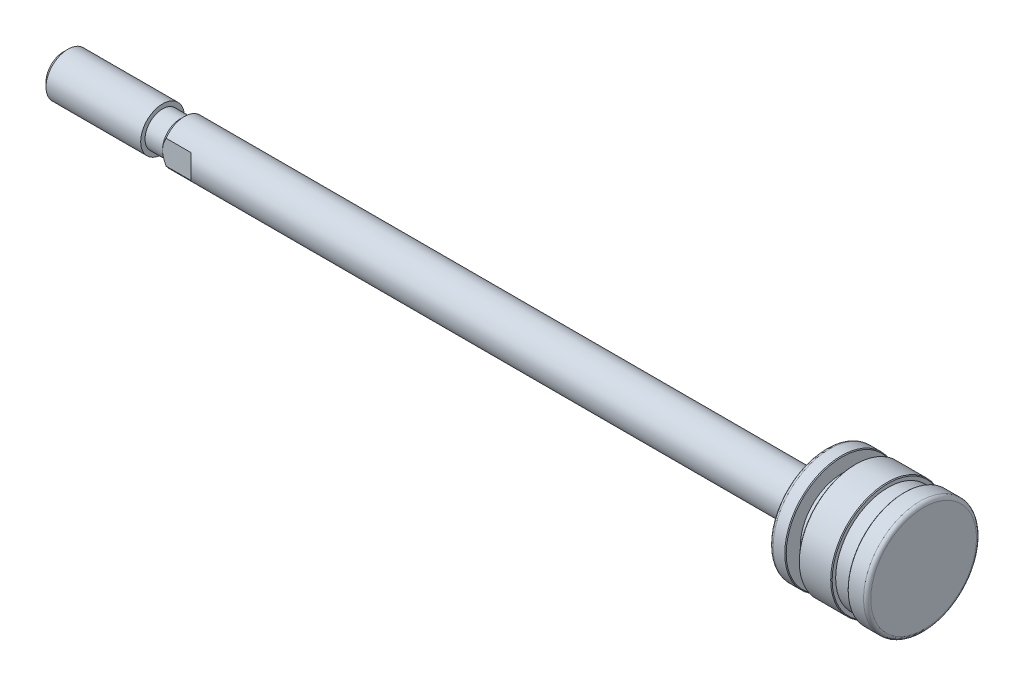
ISO-10303-21;
HEADER;
FILE_DESCRIPTION(('STEP AP214'),'2;1');
FILE_NAME('part.step','',(''),(''),'','','');
FILE_SCHEMA(('AUTOMOTIVE_DESIGN { 1 0 10303 214 1 1 1 1 }'));
ENDSEC;
DATA;
#1=APPLICATION_CONTEXT('core data for automotive mechanical design processes');
#2=APPLICATION_PROTOCOL_DEFINITION('international standard','automotive_design',2000,#1);
#3=PRODUCT_CONTEXT('',#1,'mechanical');
#4=PRODUCT('Part','Part','',(#3));
#5=PRODUCT_RELATED_PRODUCT_CATEGORY('part','',(#4));
#6=PRODUCT_DEFINITION_FORMATION('','',#4);
#7=PRODUCT_DEFINITION_CONTEXT('part definition',#1,'design');
#8=PRODUCT_DEFINITION('design','',#6,#7);
#9=PRODUCT_DEFINITION_SHAPE('','',#8);
#10=(LENGTH_UNIT() NAMED_UNIT(*) SI_UNIT(.MILLI.,.METRE.));
#11=(NAMED_UNIT(*) PLANE_ANGLE_UNIT() SI_UNIT($,.RADIAN.));
#12=(NAMED_UNIT(*) SI_UNIT($,.STERADIAN.) SOLID_ANGLE_UNIT());
#13=UNCERTAINTY_MEASURE_WITH_UNIT(LENGTH_MEASURE(1.E-05),#10,'distance_accuracy_value','');
#14=(GEOMETRIC_REPRESENTATION_CONTEXT(3) GLOBAL_UNCERTAINTY_ASSIGNED_CONTEXT((#13)) GLOBAL_UNIT_ASSIGNED_CONTEXT((#10,
#11,#12)) REPRESENTATION_CONTEXT('',''));
#15=CARTESIAN_POINT('',(0.,0.,0.));
#16=DIRECTION('',(0.,0.,1.));
#17=DIRECTION('',(1.,0.,0.));
#18=AXIS2_PLACEMENT_3D('',#15,#16,#17);
#19=CARTESIAN_POINT('',(80.,7.25,0.));
#20=DIRECTION('',(-1.,0.,0.));
#21=DIRECTION('',(0.,0.,1.));
#22=AXIS2_PLACEMENT_3D('',#19,#20,#21);
#23=PLANE('',#22);
#24=CARTESIAN_POINT('',(80.,0.,0.));
#25=DIRECTION('',(-1.,0.,0.));
#26=DIRECTION('',(0.,0.,-1.));
#27=AXIS2_PLACEMENT_3D('',#24,#25,#26);
#28=CIRCLE('',#27,7.25);
#29=CARTESIAN_POINT('',(80.,0.,-7.25));
#30=VERTEX_POINT('',#29);
#31=CARTESIAN_POINT('',(80.,0.,7.25));
#32=VERTEX_POINT('',#31);
#33=EDGE_CURVE('E237',#30,#32,#28,.T.);
#34=ORIENTED_EDGE('',*,*,#33,.F.);
#35=CARTESIAN_POINT('',(80.,0.,0.));
#36=DIRECTION('',(-1.,0.,0.));
#37=DIRECTION('',(0.,0.,1.));
#38=AXIS2_PLACEMENT_3D('',#35,#36,#37);
#39=CIRCLE('',#38,7.25);
#40=EDGE_CURVE('E539',#32,#30,#39,.T.);
#41=ORIENTED_EDGE('',*,*,#40,.F.);
#42=EDGE_LOOP('',(#34,#41));
#43=FACE_BOUND('',#42,.T.);
#44=ADVANCED_FACE('F17',(#43),#23,.F.);
#45=CARTESIAN_POINT('',(79.5,0.,0.));
#46=DIRECTION('',(-1.,0.,0.));
#47=DIRECTION('',(0.,0.,1.));
#48=AXIS2_PLACEMENT_3D('',#45,#46,#47);
#49=TOROIDAL_SURFACE('',#48,7.25,0.500000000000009);
#50=ORIENTED_EDGE('',*,*,#40,.T.);
#51=ORIENTED_EDGE('',*,*,#33,.T.);
#52=EDGE_LOOP('',(#50,#51));
#53=FACE_BOUND('',#52,.T.);
#54=CARTESIAN_POINT('',(79.5,0.,0.));
#55=DIRECTION('',(-1.,0.,0.));
#56=DIRECTION('',(0.,0.,1.));
#57=AXIS2_PLACEMENT_3D('',#54,#55,#56);
#58=CIRCLE('',#57,7.75);
#59=CARTESIAN_POINT('',(79.5,0.,7.75));
#60=VERTEX_POINT('',#59);
#61=EDGE_CURVE('E234',#60,#60,#58,.T.);
#62=ORIENTED_EDGE('',*,*,#61,.F.);
#63=EDGE_LOOP('',(#62));
#64=FACE_BOUND('',#63,.T.);
#65=ADVANCED_FACE('F242',(#53,#64),#49,.T.);
#66=CARTESIAN_POINT('',(80.,0.,0.));
#67=DIRECTION('',(-1.,0.,0.));
#68=DIRECTION('',(0.,0.,1.));
#69=AXIS2_PLACEMENT_3D('',#66,#67,#68);
#70=CYLINDRICAL_SURFACE('',#69,7.75);
#71=ORIENTED_EDGE('',*,*,#61,.T.);
#72=EDGE_LOOP('',(#71));
#73=FACE_BOUND('',#72,.T.);
#74=CARTESIAN_POINT('',(77.4,0.,0.));
#75=DIRECTION('',(1.,0.,0.));
#76=DIRECTION('',(0.,0.,-1.));
#77=AXIS2_PLACEMENT_3D('',#74,#75,#76);
#78=CIRCLE('',#77,7.75);
#79=CARTESIAN_POINT('',(77.4,0.,-7.75));
#80=VERTEX_POINT('',#79);
#81=EDGE_CURVE('E225',#80,#80,#78,.F.);
#82=ORIENTED_EDGE('',*,*,#81,.F.);
#83=EDGE_LOOP('',(#82));
#84=FACE_BOUND('',#83,.T.);
#85=ADVANCED_FACE('F246',(#73,#84),#70,.T.);
#86=CARTESIAN_POINT('',(77.4,0.,0.));
#87=DIRECTION('',(1.,0.,0.));
#88=DIRECTION('',(0.,0.,-1.));
#89=AXIS2_PLACEMENT_3D('',#86,#87,#88);
#90=CONICAL_SURFACE('',#89,7.75,0.785398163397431);
#91=CARTESIAN_POINT('',(77.3,0.,0.));
#92=DIRECTION('',(1.,0.,0.));
#93=DIRECTION('',(0.,0.,-1.));
#94=AXIS2_PLACEMENT_3D('',#91,#92,#93);
#95=CIRCLE('',#94,7.65);
#96=CARTESIAN_POINT('',(77.3,0.,-7.65));
#97=VERTEX_POINT('',#96);
#98=EDGE_CURVE('E233',#97,#97,#95,.T.);
#99=ORIENTED_EDGE('',*,*,#98,.T.);
#100=EDGE_LOOP('',(#99));
#101=FACE_BOUND('',#100,.T.);
#102=ORIENTED_EDGE('',*,*,#81,.T.);
#103=EDGE_LOOP('',(#102));
#104=FACE_BOUND('',#103,.T.);
#105=ADVANCED_FACE('F501',(#101,#104),#90,.T.);
#106=CARTESIAN_POINT('',(77.3,7.27,0.));
#107=DIRECTION('',(1.,0.,0.));
#108=DIRECTION('',(0.,0.,-1.));
#109=AXIS2_PLACEMENT_3D('',#106,#107,#108);
#110=PLANE('',#109);
#111=ORIENTED_EDGE('',*,*,#98,.F.);
#112=EDGE_LOOP('',(#111));
#113=FACE_BOUND('',#112,.T.);
#114=CARTESIAN_POINT('',(77.3,0.,0.));
#115=DIRECTION('',(-1.,0.,0.));
#116=DIRECTION('',(0.,0.,-1.));
#117=AXIS2_PLACEMENT_3D('',#114,#115,#116);
#118=CIRCLE('',#117,7.26999999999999);
#119=CARTESIAN_POINT('',(77.3,0.,7.26999999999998));
#120=VERTEX_POINT('',#119);
#121=CARTESIAN_POINT('',(77.3,0.,-7.26999999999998));
#122=VERTEX_POINT('',#121);
#123=EDGE_CURVE('E171',#120,#122,#118,.F.);
#124=ORIENTED_EDGE('',*,*,#123,.T.);
#125=CARTESIAN_POINT('',(77.3,0.,0.));
#126=DIRECTION('',(-1.,0.,0.));
#127=DIRECTION('',(0.,0.,1.));
#128=AXIS2_PLACEMENT_3D('',#125,#126,#127);
#129=CIRCLE('',#128,7.26999999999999);
#130=EDGE_CURVE('E213',#122,#120,#129,.F.);
#131=ORIENTED_EDGE('',*,*,#130,.T.);
#132=EDGE_LOOP('',(#124,#131));
#133=FACE_BOUND('',#132,.T.);
#134=ADVANCED_FACE('F188',(#113,#133),#110,.F.);
#135=CARTESIAN_POINT('',(77.2,0.,0.));
#136=DIRECTION('',(-1.,0.,0.));
#137=DIRECTION('',(0.,0.,1.));
#138=AXIS2_PLACEMENT_3D('',#135,#136,#137);
#139=TOROIDAL_SURFACE('',#138,7.26999999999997,0.099999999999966);
#140=CARTESIAN_POINT('',(77.2,0.,0.));
#141=DIRECTION('',(-1.,0.,0.));
#142=DIRECTION('',(0.,0.,1.));
#143=AXIS2_PLACEMENT_3D('',#140,#141,#142);
#144=CIRCLE('',#143,7.17);
#145=CARTESIAN_POINT('',(77.2,0.,7.17));
#146=VERTEX_POINT('',#145);
#147=EDGE_CURVE('E198',#146,#146,#144,.T.);
#148=ORIENTED_EDGE('',*,*,#147,.F.);
#149=EDGE_LOOP('',(#148));
#150=FACE_BOUND('',#149,.T.);
#151=ORIENTED_EDGE('',*,*,#123,.F.);
#152=ORIENTED_EDGE('',*,*,#130,.F.);
#153=EDGE_LOOP('',(#151,#152));
#154=FACE_BOUND('',#153,.T.);
#155=ADVANCED_FACE('F176',(#150,#154),#139,.F.);
#156=CARTESIAN_POINT('',(80.,0.,0.));
#157=DIRECTION('',(-1.,0.,0.));
#158=DIRECTION('',(0.,0.,1.));
#159=AXIS2_PLACEMENT_3D('',#156,#157,#158);
#160=CYLINDRICAL_SURFACE('',#159,7.17);
#161=CARTESIAN_POINT('',(75.1,0.,0.));
#162=DIRECTION('',(-1.,0.,0.));
#163=DIRECTION('',(0.,0.,1.));
#164=AXIS2_PLACEMENT_3D('',#161,#162,#163);
#165=CIRCLE('',#164,7.17);
#166=CARTESIAN_POINT('',(75.1,0.,7.17));
#167=VERTEX_POINT('',#166);
#168=EDGE_CURVE('E576',#167,#167,#165,.F.);
#169=ORIENTED_EDGE('',*,*,#168,.T.);
#170=EDGE_LOOP('',(#169));
#171=FACE_BOUND('',#170,.T.);
#172=ORIENTED_EDGE('',*,*,#147,.T.);
#173=EDGE_LOOP('',(#172));
#174=FACE_BOUND('',#173,.T.);
#175=ADVANCED_FACE('F187',(#171,#174),#160,.T.);
#176=CARTESIAN_POINT('',(75.1,7.65,0.));
#177=DIRECTION('',(-1.,0.,0.));
#178=DIRECTION('',(0.,0.,1.));
#179=AXIS2_PLACEMENT_3D('',#176,#177,#178);
#180=PLANE('',#179);
#181=ORIENTED_EDGE('',*,*,#168,.F.);
#182=EDGE_LOOP('',(#181));
#183=FACE_BOUND('',#182,.T.);
#184=CARTESIAN_POINT('',(75.1,0.,0.));
#185=DIRECTION('',(-1.,0.,0.));
#186=DIRECTION('',(0.,0.,1.));
#187=AXIS2_PLACEMENT_3D('',#184,#185,#186);
#188=CIRCLE('',#187,7.65);
#189=CARTESIAN_POINT('',(75.1,0.,7.65));
#190=VERTEX_POINT('',#189);
#191=EDGE_CURVE('E573',#190,#190,#188,.T.);
#192=ORIENTED_EDGE('',*,*,#191,.F.);
#193=EDGE_LOOP('',(#192));
#194=FACE_BOUND('',#193,.T.);
#195=ADVANCED_FACE('F469',(#183,#194),#180,.F.);
#196=CARTESIAN_POINT('',(75.,0.,0.));
#197=DIRECTION('',(-1.,0.,0.));
#198=DIRECTION('',(0.,0.,1.));
#199=AXIS2_PLACEMENT_3D('',#196,#197,#198);
#200=CONICAL_SURFACE('',#199,7.75,0.785398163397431);
#201=ORIENTED_EDGE('',*,*,#191,.T.);
#202=EDGE_LOOP('',(#201));
#203=FACE_BOUND('',#202,.T.);
#204=CARTESIAN_POINT('',(75.,0.,0.));
#205=DIRECTION('',(-1.,0.,0.));
#206=DIRECTION('',(0.,0.,1.));
#207=AXIS2_PLACEMENT_3D('',#204,#205,#206);
#208=CIRCLE('',#207,7.75);
#209=CARTESIAN_POINT('',(75.,0.,7.75));
#210=VERTEX_POINT('',#209);
#211=EDGE_CURVE('E571',#210,#210,#208,.T.);
#212=ORIENTED_EDGE('',*,*,#211,.F.);
#213=EDGE_LOOP('',(#212));
#214=FACE_BOUND('',#213,.T.);
#215=ADVANCED_FACE('F459',(#203,#214),#200,.T.);
#216=CARTESIAN_POINT('',(80.,0.,0.));
#217=DIRECTION('',(-1.,0.,0.));
#218=DIRECTION('',(0.,0.,1.));
#219=AXIS2_PLACEMENT_3D('',#216,#217,#218);
#220=CYLINDRICAL_SURFACE('',#219,7.75);
#221=ORIENTED_EDGE('',*,*,#211,.T.);
#222=EDGE_LOOP('',(#221));
#223=FACE_BOUND('',#222,.T.);
#224=CARTESIAN_POINT('',(70.7,0.,0.));
#225=DIRECTION('',(1.,0.,0.));
#226=DIRECTION('',(0.,0.,-1.));
#227=AXIS2_PLACEMENT_3D('',#224,#225,#226);
#228=CIRCLE('',#227,7.75);
#229=CARTESIAN_POINT('',(70.7,0.,-7.75));
#230=VERTEX_POINT('',#229);
#231=EDGE_CURVE('E568',#230,#230,#228,.F.);
#232=ORIENTED_EDGE('',*,*,#231,.F.);
#233=EDGE_LOOP('',(#232));
#234=FACE_BOUND('',#233,.T.);
#235=ADVANCED_FACE('F449',(#223,#234),#220,.T.);
#236=CARTESIAN_POINT('',(70.7,0.,0.));
#237=DIRECTION('',(1.,0.,0.));
#238=DIRECTION('',(0.,0.,-1.));
#239=AXIS2_PLACEMENT_3D('',#236,#237,#238);
#240=CONICAL_SURFACE('',#239,7.75,0.7853981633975);
#241=CARTESIAN_POINT('',(70.6,0.,0.));
#242=DIRECTION('',(1.,0.,0.));
#243=DIRECTION('',(0.,0.,-1.));
#244=AXIS2_PLACEMENT_3D('',#241,#242,#243);
#245=CIRCLE('',#244,7.65);
#246=CARTESIAN_POINT('',(70.6,0.,-7.65));
#247=VERTEX_POINT('',#246);
#248=EDGE_CURVE('E570',#247,#247,#245,.T.);
#249=ORIENTED_EDGE('',*,*,#248,.T.);
#250=EDGE_LOOP('',(#249));
#251=FACE_BOUND('',#250,.T.);
#252=ORIENTED_EDGE('',*,*,#231,.T.);
#253=EDGE_LOOP('',(#252));
#254=FACE_BOUND('',#253,.T.);
#255=ADVANCED_FACE('F439',(#251,#254),#240,.T.);
#256=CARTESIAN_POINT('',(70.6,5.7,0.));
#257=DIRECTION('',(1.,0.,0.));
#258=DIRECTION('',(0.,0.,-1.));
#259=AXIS2_PLACEMENT_3D('',#256,#257,#258);
#260=PLANE('',#259);
#261=ORIENTED_EDGE('',*,*,#248,.F.);
#262=EDGE_LOOP('',(#261));
#263=FACE_BOUND('',#262,.T.);
#264=CARTESIAN_POINT('',(70.6,0.,0.));
#265=DIRECTION('',(-1.,0.,0.));
#266=DIRECTION('',(0.,0.,1.));
#267=AXIS2_PLACEMENT_3D('',#264,#265,#266);
#268=CIRCLE('',#267,5.7);
#269=CARTESIAN_POINT('',(70.6,0.,5.7));
#270=VERTEX_POINT('',#269);
#271=EDGE_CURVE('E589',#270,#270,#268,.T.);
#272=ORIENTED_EDGE('',*,*,#271,.F.);
#273=EDGE_LOOP('',(#272));
#274=FACE_BOUND('',#273,.T.);
#275=ADVANCED_FACE('F429',(#263,#274),#260,.F.);
#276=CARTESIAN_POINT('',(80.,0.,0.));
#277=DIRECTION('',(-1.,0.,0.));
#278=DIRECTION('',(0.,0.,1.));
#279=AXIS2_PLACEMENT_3D('',#276,#277,#278);
#280=CYLINDRICAL_SURFACE('',#279,5.7);
#281=CARTESIAN_POINT('',(68.8,0.,0.));
#282=DIRECTION('',(-1.,0.,0.));
#283=DIRECTION('',(0.,0.,1.));
#284=AXIS2_PLACEMENT_3D('',#281,#282,#283);
#285=CIRCLE('',#284,5.7);
#286=CARTESIAN_POINT('',(68.8,0.,5.7));
#287=VERTEX_POINT('',#286);
#288=EDGE_CURVE('E592',#287,#287,#285,.F.);
#289=ORIENTED_EDGE('',*,*,#288,.T.);
#290=EDGE_LOOP('',(#289));
#291=FACE_BOUND('',#290,.T.);
#292=ORIENTED_EDGE('',*,*,#271,.T.);
#293=EDGE_LOOP('',(#292));
#294=FACE_BOUND('',#293,.T.);
#295=ADVANCED_FACE('F419',(#291,#294),#280,.T.);
#296=CARTESIAN_POINT('',(68.8,7.65,0.));
#297=DIRECTION('',(-1.,0.,0.));
#298=DIRECTION('',(0.,0.,1.));
#299=AXIS2_PLACEMENT_3D('',#296,#297,#298);
#300=PLANE('',#299);
#301=ORIENTED_EDGE('',*,*,#288,.F.);
#302=EDGE_LOOP('',(#301));
#303=FACE_BOUND('',#302,.T.);
#304=CARTESIAN_POINT('',(68.8,0.,0.));
#305=DIRECTION('',(-1.,0.,0.));
#306=DIRECTION('',(0.,0.,1.));
#307=AXIS2_PLACEMENT_3D('',#304,#305,#306);
#308=CIRCLE('',#307,7.65);
#309=CARTESIAN_POINT('',(68.8,0.,7.65));
#310=VERTEX_POINT('',#309);
#311=EDGE_CURVE('E567',#310,#310,#308,.T.);
#312=ORIENTED_EDGE('',*,*,#311,.F.);
#313=EDGE_LOOP('',(#312));
#314=FACE_BOUND('',#313,.T.);
#315=ADVANCED_FACE('F409',(#303,#314),#300,.F.);
#316=CARTESIAN_POINT('',(68.7,0.,0.));
#317=DIRECTION('',(-1.,0.,0.));
#318=DIRECTION('',(0.,0.,1.));
#319=AXIS2_PLACEMENT_3D('',#316,#317,#318);
#320=CONICAL_SURFACE('',#319,7.74999999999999,0.7853981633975);
#321=CARTESIAN_POINT('',(68.7,0.,0.));
#322=DIRECTION('',(-1.,0.,0.));
#323=DIRECTION('',(0.,0.,1.));
#324=AXIS2_PLACEMENT_3D('',#321,#322,#323);
#325=CIRCLE('',#324,7.75);
#326=CARTESIAN_POINT('',(68.7,0.,7.75));
#327=VERTEX_POINT('',#326);
#328=EDGE_CURVE('E564',#327,#327,#325,.T.);
#329=ORIENTED_EDGE('',*,*,#328,.F.);
#330=EDGE_LOOP('',(#329));
#331=FACE_BOUND('',#330,.T.);
#332=ORIENTED_EDGE('',*,*,#311,.T.);
#333=EDGE_LOOP('',(#332));
#334=FACE_BOUND('',#333,.T.);
#335=ADVANCED_FACE('F399',(#331,#334),#320,.T.);
#336=CARTESIAN_POINT('',(-38.,0.,0.));
#337=DIRECTION('',(1.,0.,0.));
#338=DIRECTION('',(0.,0.,-1.));
#339=AXIS2_PLACEMENT_3D('',#336,#337,#338);
#340=PLANE('',#339);
#341=CARTESIAN_POINT('',(-37.9999999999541,0.,0.));
#342=DIRECTION('',(1.,0.,0.));
#343=DIRECTION('',(0.,0.,-1.));
#344=AXIS2_PLACEMENT_3D('',#341,#342,#343);
#345=CIRCLE('',#344,2.38649999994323);
#346=CARTESIAN_POINT('',(-37.9999999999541,0.,-2.38649999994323));
#347=VERTEX_POINT('',#346);
#348=EDGE_CURVE('E561',#347,#347,#345,.T.);
#349=ORIENTED_EDGE('',*,*,#348,.F.);
#350=EDGE_LOOP('',(#349));
#351=FACE_BOUND('',#350,.T.);
#352=ADVANCED_FACE('F390',(#351),#340,.F.);
#353=CARTESIAN_POINT('',(80.,0.,0.));
#354=DIRECTION('',(-1.,0.,0.));
#355=DIRECTION('',(0.,0.,1.));
#356=AXIS2_PLACEMENT_3D('',#353,#354,#355);
#357=CYLINDRICAL_SURFACE('',#356,7.75);
#358=CARTESIAN_POINT('',(67.1,0.,0.));
#359=DIRECTION('',(-1.,0.,0.));
#360=DIRECTION('',(0.,0.,1.));
#361=AXIS2_PLACEMENT_3D('',#358,#359,#360);
#362=CIRCLE('',#361,7.75);
#363=CARTESIAN_POINT('',(67.1,0.,7.75));
#364=VERTEX_POINT('',#363);
#365=EDGE_CURVE('E558',#364,#364,#362,.T.);
#366=ORIENTED_EDGE('',*,*,#365,.F.);
#367=EDGE_LOOP('',(#366));
#368=FACE_BOUND('',#367,.T.);
#369=ORIENTED_EDGE('',*,*,#328,.T.);
#370=EDGE_LOOP('',(#369));
#371=FACE_BOUND('',#370,.T.);
#372=ADVANCED_FACE('F381',(#368,#371),#357,.T.);
#373=CARTESIAN_POINT('',(-37.3864999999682,0.,0.));
#374=DIRECTION('',(1.,0.,0.));
#375=DIRECTION('',(0.,0.,-1.));
#376=AXIS2_PLACEMENT_3D('',#373,#374,#375);
#377=CONICAL_SURFACE('',#376,2.99999999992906,0.785398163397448);
#378=CARTESIAN_POINT('',(-37.3865,0.,0.));
#379=DIRECTION('',(-1.,0.,0.));
#380=DIRECTION('',(0.,0.,1.));
#381=AXIS2_PLACEMENT_3D('',#378,#379,#380);
#382=CIRCLE('',#381,3.);
#383=CARTESIAN_POINT('',(-37.3865,0.,3.));
#384=VERTEX_POINT('',#383);
#385=EDGE_CURVE('E556',#384,#384,#382,.F.);
#386=ORIENTED_EDGE('',*,*,#385,.F.);
#387=EDGE_LOOP('',(#386));
#388=FACE_BOUND('',#387,.T.);
#389=ORIENTED_EDGE('',*,*,#348,.T.);
#390=EDGE_LOOP('',(#389));
#391=FACE_BOUND('',#390,.T.);
#392=ADVANCED_FACE('F147',(#388,#391),#377,.T.);
#393=CARTESIAN_POINT('',(67.1,0.,0.));
#394=DIRECTION('',(-1.,0.,0.));
#395=DIRECTION('',(0.,0.,1.));
#396=AXIS2_PLACEMENT_3D('',#393,#394,#395);
#397=TOROIDAL_SURFACE('',#396,7.25,0.500000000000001);
#398=CARTESIAN_POINT('',(66.6,0.,0.));
#399=DIRECTION('',(1.,0.,0.));
#400=DIRECTION('',(0.,0.,1.));
#401=AXIS2_PLACEMENT_3D('',#398,#399,#400);
#402=CIRCLE('',#401,7.25);
#403=CARTESIAN_POINT('',(66.6,0.,7.25));
#404=VERTEX_POINT('',#403);
#405=CARTESIAN_POINT('',(66.6,0.,-7.25));
#406=VERTEX_POINT('',#405);
#407=EDGE_CURVE('E110',#404,#406,#402,.T.);
#408=ORIENTED_EDGE('',*,*,#407,.T.);
#409=CARTESIAN_POINT('',(66.6,0.,0.));
#410=DIRECTION('',(1.,0.,0.));
#411=DIRECTION('',(0.,0.,-1.));
#412=AXIS2_PLACEMENT_3D('',#409,#410,#411);
#413=CIRCLE('',#412,7.25);
#414=EDGE_CURVE('E550',#406,#404,#413,.T.);
#415=ORIENTED_EDGE('',*,*,#414,.T.);
#416=EDGE_LOOP('',(#408,#415));
#417=FACE_BOUND('',#416,.T.);
#418=ORIENTED_EDGE('',*,*,#365,.T.);
#419=EDGE_LOOP('',(#418));
#420=FACE_BOUND('',#419,.T.);
#421=ADVANCED_FACE('F143',(#417,#420),#397,.T.);
#422=CARTESIAN_POINT('',(80.,0.,0.));
#423=DIRECTION('',(-1.,0.,0.));
#424=DIRECTION('',(0.,0.,1.));
#425=AXIS2_PLACEMENT_3D('',#422,#423,#424);
#426=CYLINDRICAL_SURFACE('',#425,3.);
#427=ORIENTED_EDGE('',*,*,#385,.T.);
#428=EDGE_LOOP('',(#427));
#429=FACE_BOUND('',#428,.T.);
#430=CARTESIAN_POINT('',(-24.4,0.,0.));
#431=DIRECTION('',(-1.,0.,0.));
#432=DIRECTION('',(0.,0.,1.));
#433=AXIS2_PLACEMENT_3D('',#430,#431,#432);
#434=CIRCLE('',#433,3.);
#435=CARTESIAN_POINT('',(-24.4,0.,3.));
#436=VERTEX_POINT('',#435);
#437=EDGE_CURVE('E552',#436,#436,#434,.T.);
#438=ORIENTED_EDGE('',*,*,#437,.T.);
#439=EDGE_LOOP('',(#438));
#440=FACE_BOUND('',#439,.T.);
#441=ADVANCED_FACE('F127',(#429,#440),#426,.T.);
#442=CARTESIAN_POINT('',(66.6,2.9,0.));
#443=DIRECTION('',(1.,0.,0.));
#444=DIRECTION('',(0.,0.,-1.));
#445=AXIS2_PLACEMENT_3D('',#442,#443,#444);
#446=PLANE('',#445);
#447=ORIENTED_EDGE('',*,*,#407,.F.);
#448=ORIENTED_EDGE('',*,*,#414,.F.);
#449=EDGE_LOOP('',(#447,#448));
#450=FACE_BOUND('',#449,.T.);
#451=CARTESIAN_POINT('',(66.6,0.,0.));
#452=DIRECTION('',(-1.,0.,0.));
#453=DIRECTION('',(0.,0.,1.));
#454=AXIS2_PLACEMENT_3D('',#451,#452,#453);
#455=CIRCLE('',#454,2.9);
#456=CARTESIAN_POINT('',(66.6,0.,2.9));
#457=VERTEX_POINT('',#456);
#458=EDGE_CURVE('E554',#457,#457,#455,.T.);
#459=ORIENTED_EDGE('',*,*,#458,.F.);
#460=EDGE_LOOP('',(#459));
#461=FACE_BOUND('',#460,.T.);
#462=ADVANCED_FACE('F116',(#450,#461),#446,.F.);
#463=CARTESIAN_POINT('',(-24.4,3.,0.));
#464=DIRECTION('',(-1.,0.,0.));
#465=DIRECTION('',(0.,0.,1.));
#466=AXIS2_PLACEMENT_3D('',#463,#464,#465);
#467=PLANE('',#466);
#468=CARTESIAN_POINT('',(-24.4,0.,0.));
#469=DIRECTION('',(-1.,0.,0.));
#470=DIRECTION('',(0.,0.,1.));
#471=AXIS2_PLACEMENT_3D('',#468,#469,#470);
#472=CIRCLE('',#471,2.4);
#473=CARTESIAN_POINT('',(-24.4,0.,2.4));
#474=VERTEX_POINT('',#473);
#475=EDGE_CURVE('E601',#474,#474,#472,.F.);
#476=ORIENTED_EDGE('',*,*,#475,.F.);
#477=EDGE_LOOP('',(#476));
#478=FACE_BOUND('',#477,.T.);
#479=ORIENTED_EDGE('',*,*,#437,.F.);
#480=EDGE_LOOP('',(#479));
#481=FACE_BOUND('',#480,.T.);
#482=ADVANCED_FACE('F126',(#478,#481),#467,.F.);
#483=CARTESIAN_POINT('',(80.,0.,0.));
#484=DIRECTION('',(-1.,0.,0.));
#485=DIRECTION('',(0.,0.,1.));
#486=AXIS2_PLACEMENT_3D('',#483,#484,#485);
#487=CYLINDRICAL_SURFACE('',#486,2.9);
#488=CARTESIAN_POINT('',(64.1,0.,0.));
#489=DIRECTION('',(-1.,0.,0.));
#490=DIRECTION('',(0.,0.,1.));
#491=AXIS2_PLACEMENT_3D('',#488,#489,#490);
#492=CIRCLE('',#491,2.9);
#493=CARTESIAN_POINT('',(64.1,0.,2.9));
#494=VERTEX_POINT('',#493);
#495=EDGE_CURVE('E100',#494,#494,#492,.F.);
#496=ORIENTED_EDGE('',*,*,#495,.T.);
#497=EDGE_LOOP('',(#496));
#498=FACE_BOUND('',#497,.T.);
#499=ORIENTED_EDGE('',*,*,#458,.T.);
#500=EDGE_LOOP('',(#499));
#501=FACE_BOUND('',#500,.T.);
#502=ADVANCED_FACE('F292',(#498,#501),#487,.T.);
#503=CARTESIAN_POINT('',(80.,0.,0.));
#504=DIRECTION('',(-1.,0.,0.));
#505=DIRECTION('',(0.,0.,1.));
#506=AXIS2_PLACEMENT_3D('',#503,#504,#505);
#507=CYLINDRICAL_SURFACE('',#506,2.4);
#508=ORIENTED_EDGE('',*,*,#475,.T.);
#509=EDGE_LOOP('',(#508));
#510=FACE_BOUND('',#509,.T.);
#511=CARTESIAN_POINT('',(-21.9999999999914,0.,0.));
#512=DIRECTION('',(1.,0.,0.));
#513=DIRECTION('',(0.,0.,-1.));
#514=AXIS2_PLACEMENT_3D('',#511,#512,#513);
#515=CIRCLE('',#514,2.40000000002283);
#516=CARTESIAN_POINT('',(-21.9999999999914,0.,-2.40000000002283));
#517=VERTEX_POINT('',#516);
#518=EDGE_CURVE('E75',#517,#517,#515,.T.);
#519=ORIENTED_EDGE('',*,*,#518,.F.);
#520=EDGE_LOOP('',(#519));
#521=FACE_BOUND('',#520,.T.);
#522=ADVANCED_FACE('F289',(#510,#521),#507,.T.);
#523=CARTESIAN_POINT('',(64.1,3.,0.));
#524=DIRECTION('',(-1.,0.,0.));
#525=DIRECTION('',(0.,0.,1.));
#526=AXIS2_PLACEMENT_3D('',#523,#524,#525);
#527=PLANE('',#526);
#528=ORIENTED_EDGE('',*,*,#495,.F.);
#529=EDGE_LOOP('',(#528));
#530=FACE_BOUND('',#529,.T.);
#531=CARTESIAN_POINT('',(64.1,0.,0.));
#532=DIRECTION('',(-1.,0.,0.));
#533=DIRECTION('',(0.,0.,1.));
#534=AXIS2_PLACEMENT_3D('',#531,#532,#533);
#535=CIRCLE('',#534,3.);
#536=CARTESIAN_POINT('',(64.1,0.,3.));
#537=VERTEX_POINT('',#536);
#538=EDGE_CURVE('E88',#537,#537,#535,.T.);
#539=ORIENTED_EDGE('',*,*,#538,.F.);
#540=EDGE_LOOP('',(#539));
#541=FACE_BOUND('',#540,.T.);
#542=ADVANCED_FACE('F285',(#530,#541),#527,.F.);
#543=CARTESIAN_POINT('',(-18.,-6.,-2.5));
#544=DIRECTION('',(0.707106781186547,0.,0.707106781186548));
#545=DIRECTION('',(0.707106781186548,0.,-0.707106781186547));
#546=AXIS2_PLACEMENT_3D('',#543,#544,#545);
#547=PLANE('',#546);
#548=CARTESIAN_POINT('',(-20.5,0.,0.));
#549=DIRECTION('',(0.707106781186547,0.,0.707106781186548));
#550=DIRECTION('',(-0.707106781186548,0.,0.707106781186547));
#551=AXIS2_PLACEMENT_3D('',#548,#549,#550);
#552=ELLIPSE('',#551,4.24264068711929,3.);
#553=CARTESIAN_POINT('',(-18.,-1.65831239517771,-2.5));
#554=VERTEX_POINT('',#553);
#555=CARTESIAN_POINT('',(-18.,1.65831239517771,-2.5));
#556=VERTEX_POINT('',#555);
#557=EDGE_CURVE('E86',#554,#556,#552,.T.);
#558=ORIENTED_EDGE('',*,*,#557,.F.);
#559=DIRECTION('',(0.,1.,0.));
#560=VECTOR('',#559,1.);
#561=CARTESIAN_POINT('',(-18.,-6.,-2.5));
#562=LINE('',#561,#560);
#563=EDGE_CURVE('E98',#554,#556,#562,.T.);
#564=ORIENTED_EDGE('',*,*,#563,.T.);
#565=EDGE_LOOP('',(#558,#564));
#566=FACE_BOUND('',#565,.T.);
#567=ADVANCED_FACE('F282',(#566),#547,.F.);
#568=CARTESIAN_POINT('',(-22.,-6.,-2.5));
#569=DIRECTION('',(0.,0.,1.));
#570=DIRECTION('',(1.,0.,0.));
#571=AXIS2_PLACEMENT_3D('',#568,#569,#570);
#572=PLANE('',#571);
#573=DIRECTION('',(-1.,0.,0.));
#574=VECTOR('',#573,1.);
#575=CARTESIAN_POINT('',(80.,-1.6583123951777,-2.5));
#576=LINE('',#575,#574);
#577=CARTESIAN_POINT('',(-21.4000000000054,-1.65831239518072,-2.5));
#578=VERTEX_POINT('',#577);
#579=EDGE_CURVE('E70',#578,#554,#576,.F.);
#580=ORIENTED_EDGE('',*,*,#579,.F.);
#581=CARTESIAN_POINT('',(-21.400000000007,1.65831239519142,-2.50000000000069));
#582=CARTESIAN_POINT('',(-21.4245861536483,1.61382941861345,-2.50000000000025));
#583=CARTESIAN_POINT('',(-21.4486501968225,1.56905834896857,-2.50000000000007));
#584=CARTESIAN_POINT('',(-21.4955741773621,1.47890952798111,-2.49999999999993));
#585=CARTESIAN_POINT('',(-21.5184345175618,1.43353198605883,-2.49999999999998));
#586=CARTESIAN_POINT('',(-21.5851938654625,1.29598840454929,-2.50000000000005));
#587=CARTESIAN_POINT('',(-21.6270477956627,1.20280974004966,-2.50000000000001));
#588=CARTESIAN_POINT('',(-21.7040452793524,1.01280380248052,-2.49999999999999));
#589=CARTESIAN_POINT('',(-21.7391317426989,0.915953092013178,-2.5));
#590=CARTESIAN_POINT('',(-21.8002114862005,0.719439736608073,-2.5));
#591=CARTESIAN_POINT('',(-21.8262119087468,0.61977936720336,-2.5));
#592=CARTESIAN_POINT('',(-21.8640809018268,0.433468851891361,-2.5));
#593=CARTESIAN_POINT('',(-21.8774939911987,0.347135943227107,-2.5));
#594=CARTESIAN_POINT('',(-21.895435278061,0.173863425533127,-2.5));
#595=CARTESIAN_POINT('',(-21.8999977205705,0.086927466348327,-2.5));
#596=CARTESIAN_POINT('',(-21.9000019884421,-0.0758294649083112,-2.5));
#597=CARTESIAN_POINT('',(-21.8965338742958,-0.151652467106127,-2.5));
#598=CARTESIAN_POINT('',(-21.882863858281,-0.302712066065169,-2.5));
#599=CARTESIAN_POINT('',(-21.8726593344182,-0.377948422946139,-2.5));
#600=CARTESIAN_POINT('',(-21.8459656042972,-0.527795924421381,-2.5));
#601=CARTESIAN_POINT('',(-21.8294351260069,-0.602399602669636,-2.5));
#602=CARTESIAN_POINT('',(-21.7908506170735,-0.750168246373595,-2.5));
#603=CARTESIAN_POINT('',(-21.7687950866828,-0.823332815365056,-2.5));
#604=CARTESIAN_POINT('',(-21.7219215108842,-0.962309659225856,-2.5));
#605=CARTESIAN_POINT('',(-21.697461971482,-1.02824437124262,-2.5));
#606=CARTESIAN_POINT('',(-21.6451585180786,-1.15876068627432,-2.5));
#607=CARTESIAN_POINT('',(-21.6173140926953,-1.22334208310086,-2.5));
#608=CARTESIAN_POINT('',(-21.5591744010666,-1.3503482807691,-2.5));
#609=CARTESIAN_POINT('',(-21.5289164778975,-1.41279031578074,-2.5));
#610=CARTESIAN_POINT('',(-21.4660889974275,-1.53644034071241,-2.5));
#611=CARTESIAN_POINT('',(-21.4335213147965,-1.59764928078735,-2.5));
#612=CARTESIAN_POINT('',(-21.4000000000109,-1.65831239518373,-2.5));
#613=B_SPLINE_CURVE_WITH_KNOTS('',3,(#581,#582,#583,#584,#585,#586,#587,#588,#589,#590,#591,
#592,#593,#594,#595,#596,#597,#598,#599,#600,#601,#602,#603,#604,#605,#606,#607,#608,#609,#610,
#611,#612),.UNSPECIFIED.,.F.,.F.,(4,2,2,2,2,2,2,2,2,2,2,2,2,2,2,4),(0.,0.152469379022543,
0.304887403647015,0.611091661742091,0.919775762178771,1.22821666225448,1.48991340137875,
1.75059554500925,1.97799648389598,2.20548598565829,2.43448570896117,2.66354766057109,
2.87441784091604,3.08531991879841,3.29342880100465,3.50137066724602),.UNSPECIFIED.);
#614=CARTESIAN_POINT('',(-21.4000000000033,1.65831239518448,-2.5));
#615=VERTEX_POINT('',#614);
#616=EDGE_CURVE('E62',#615,#578,#613,.T.);
#617=ORIENTED_EDGE('',*,*,#616,.F.);
#618=DIRECTION('',(-1.,0.,0.));
#619=VECTOR('',#618,1.);
#620=CARTESIAN_POINT('',(80.,1.6583123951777,-2.5));
#621=LINE('',#620,#619);
#622=EDGE_CURVE('E67',#556,#615,#621,.T.);
#623=ORIENTED_EDGE('',*,*,#622,.F.);
#624=ORIENTED_EDGE('',*,*,#563,.F.);
#625=EDGE_LOOP('',(#580,#617,#623,#624));
#626=FACE_BOUND('',#625,.T.);
#627=ADVANCED_FACE('F64',(#626),#572,.F.);
#628=CARTESIAN_POINT('',(-21.3999999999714,0.,0.));
#629=DIRECTION('',(1.,0.,0.));
#630=DIRECTION('',(0.,0.,-1.));
#631=AXIS2_PLACEMENT_3D('',#628,#629,#630);
#632=CONICAL_SURFACE('',#631,3.00000000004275,0.785398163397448);
#633=CARTESIAN_POINT('',(-21.3999999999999,0.,0.));
#634=DIRECTION('',(-1.,0.,0.));
#635=DIRECTION('',(0.,0.,1.));
#636=AXIS2_PLACEMENT_3D('',#633,#634,#635);
#637=CIRCLE('',#636,3.);
#638=CARTESIAN_POINT('',(-21.4000000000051,-1.6583123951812,2.5));
#639=VERTEX_POINT('',#638);
#640=EDGE_CURVE('E93',#639,#578,#637,.F.);
#641=ORIENTED_EDGE('',*,*,#640,.F.);
#642=CARTESIAN_POINT('',(-21.4000000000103,-1.65831239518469,2.5));
#643=CARTESIAN_POINT('',(-21.4245861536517,-1.61382941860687,2.5));
#644=CARTESIAN_POINT('',(-21.4486501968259,-1.56905834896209,2.5));
#645=CARTESIAN_POINT('',(-21.4955741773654,-1.47890952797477,2.5));
#646=CARTESIAN_POINT('',(-21.518434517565,-1.43353198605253,2.5));
#647=CARTESIAN_POINT('',(-21.5851938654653,-1.29598840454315,2.5));
#648=CARTESIAN_POINT('',(-21.6270477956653,-1.20280974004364,2.5));
#649=CARTESIAN_POINT('',(-21.7040452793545,-1.01280380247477,2.5));
#650=CARTESIAN_POINT('',(-21.7391317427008,-0.915953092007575,2.5));
#651=CARTESIAN_POINT('',(-21.800211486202,-0.719439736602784,2.5));
#652=CARTESIAN_POINT('',(-21.826211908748,-0.619779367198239,2.5));
#653=CARTESIAN_POINT('',(-21.8640809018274,-0.433468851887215,2.5));
#654=CARTESIAN_POINT('',(-21.8774939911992,-0.347135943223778,2.5));
#655=CARTESIAN_POINT('',(-21.8954352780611,-0.173863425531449,2.5));
#656=CARTESIAN_POINT('',(-21.8999977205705,-0.0869274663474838,2.5));
#657=CARTESIAN_POINT('',(-21.9000019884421,0.0758294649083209,2.5));
#658=CARTESIAN_POINT('',(-21.8965338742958,0.151652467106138,2.5));
#659=CARTESIAN_POINT('',(-21.882863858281,0.302712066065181,2.5));
#660=CARTESIAN_POINT('',(-21.8726593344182,0.377948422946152,2.5));
#661=CARTESIAN_POINT('',(-21.8459656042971,0.527795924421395,2.5));
#662=CARTESIAN_POINT('',(-21.8294351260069,0.60239960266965,2.5));
#663=CARTESIAN_POINT('',(-21.7908506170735,0.750168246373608,2.5));
#664=CARTESIAN_POINT('',(-21.7687950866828,0.823332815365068,2.5));
#665=CARTESIAN_POINT('',(-21.7219215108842,0.962309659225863,2.5));
#666=CARTESIAN_POINT('',(-21.697461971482,1.02824437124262,2.5));
#667=CARTESIAN_POINT('',(-21.6451585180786,1.15876068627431,2.5));
#668=CARTESIAN_POINT('',(-21.6173140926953,1.22334208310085,2.5));
#669=CARTESIAN_POINT('',(-21.5591744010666,1.35034828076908,2.5));
#670=CARTESIAN_POINT('',(-21.5289164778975,1.41279031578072,2.5));
#671=CARTESIAN_POINT('',(-21.4660889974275,1.53644034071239,2.5));
#672=CARTESIAN_POINT('',(-21.4335213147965,1.59764928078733,2.5));
#673=CARTESIAN_POINT('',(-21.4000000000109,1.65831239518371,2.5));
#674=B_SPLINE_CURVE_WITH_KNOTS('',3,(#642,#643,#644,#645,#646,#647,#648,#649,#650,#651,#652,
#653,#654,#655,#656,#657,#658,#659,#660,#661,#662,#663,#664,#665,#666,#667,#668,#669,#670,#671,
#672,#673),.UNSPECIFIED.,.F.,.F.,(4,2,2,2,2,2,2,2,2,2,2,2,2,2,2,4),(0.,0.152469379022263,
0.304887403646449,0.611091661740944,0.919775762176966,1.22821666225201,1.48991340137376,
1.75059554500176,1.97799648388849,2.2054859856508,2.43448570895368,2.6635476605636,
2.87441784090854,3.0853199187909,3.29342880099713,3.50137066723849),.UNSPECIFIED.);
#675=CARTESIAN_POINT('',(-21.4000000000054,1.6583123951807,2.5));
#676=VERTEX_POINT('',#675);
#677=EDGE_CURVE('E74',#639,#676,#674,.T.);
#678=ORIENTED_EDGE('',*,*,#677,.T.);
#679=CARTESIAN_POINT('',(-21.4,0.,0.));
#680=DIRECTION('',(-1.,0.,0.));
#681=DIRECTION('',(0.,0.,1.));
#682=AXIS2_PLACEMENT_3D('',#679,#680,#681);
#683=CIRCLE('',#682,3.);
#684=EDGE_CURVE('E78',#615,#676,#683,.F.);
#685=ORIENTED_EDGE('',*,*,#684,.F.);
#686=ORIENTED_EDGE('',*,*,#616,.T.);
#687=EDGE_LOOP('',(#641,#678,#685,#686));
#688=FACE_BOUND('',#687,.T.);
#689=ORIENTED_EDGE('',*,*,#518,.T.);
#690=EDGE_LOOP('',(#689));
#691=FACE_BOUND('',#690,.T.);
#692=ADVANCED_FACE('F79',(#688,#691),#632,.T.);
#693=CARTESIAN_POINT('',(-18.,-6.,2.5));
#694=DIRECTION('',(0.,0.,-1.));
#695=DIRECTION('',(-1.,0.,0.));
#696=AXIS2_PLACEMENT_3D('',#693,#694,#695);
#697=PLANE('',#696);
#698=DIRECTION('',(-1.,0.,0.));
#699=VECTOR('',#698,1.);
#700=CARTESIAN_POINT('',(80.,1.6583123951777,2.5));
#701=LINE('',#700,#699);
#702=CARTESIAN_POINT('',(-18.,1.65831239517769,2.5));
#703=VERTEX_POINT('',#702);
#704=EDGE_CURVE('E28',#676,#703,#701,.F.);
#705=ORIENTED_EDGE('',*,*,#704,.F.);
#706=ORIENTED_EDGE('',*,*,#677,.F.);
#707=DIRECTION('',(-1.,0.,0.));
#708=VECTOR('',#707,1.);
#709=CARTESIAN_POINT('',(80.,-1.65831239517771,2.5));
#710=LINE('',#709,#708);
#711=CARTESIAN_POINT('',(-18.,-1.6583123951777,2.5));
#712=VERTEX_POINT('',#711);
#713=EDGE_CURVE('E94',#712,#639,#710,.T.);
#714=ORIENTED_EDGE('',*,*,#713,.F.);
#715=DIRECTION('',(0.,1.,0.));
#716=VECTOR('',#715,1.);
#717=CARTESIAN_POINT('',(-18.,-6.,2.5));
#718=LINE('',#717,#716);
#719=EDGE_CURVE('E37',#712,#703,#718,.T.);
#720=ORIENTED_EDGE('',*,*,#719,.T.);
#721=EDGE_LOOP('',(#705,#706,#714,#720));
#722=FACE_BOUND('',#721,.T.);
#723=ADVANCED_FACE('F273',(#722),#697,.F.);
#724=CARTESIAN_POINT('',(-13.,-6.,7.5));
#725=DIRECTION('',(0.707106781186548,0.,-0.707106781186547));
#726=DIRECTION('',(-0.707106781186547,0.,-0.707106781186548));
#727=AXIS2_PLACEMENT_3D('',#724,#725,#726);
#728=PLANE('',#727);
#729=ORIENTED_EDGE('',*,*,#719,.F.);
#730=CARTESIAN_POINT('',(-20.5,0.,0.));
#731=DIRECTION('',(0.707106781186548,0.,-0.707106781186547));
#732=DIRECTION('',(-0.707106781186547,0.,-0.707106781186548));
#733=AXIS2_PLACEMENT_3D('',#730,#731,#732);
#734=ELLIPSE('',#733,4.24264068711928,3.);
#735=EDGE_CURVE('E11',#703,#712,#734,.T.);
#736=ORIENTED_EDGE('',*,*,#735,.F.);
#737=EDGE_LOOP('',(#729,#736));
#738=FACE_BOUND('',#737,.T.);
#739=ADVANCED_FACE('F304',(#738),#728,.F.);
#740=CARTESIAN_POINT('',(80.,0.,0.));
#741=DIRECTION('',(-1.,0.,0.));
#742=DIRECTION('',(0.,0.,1.));
#743=AXIS2_PLACEMENT_3D('',#740,#741,#742);
#744=CYLINDRICAL_SURFACE('',#743,3.);
#745=ORIENTED_EDGE('',*,*,#579,.T.);
#746=ORIENTED_EDGE('',*,*,#557,.T.);
#747=ORIENTED_EDGE('',*,*,#622,.T.);
#748=ORIENTED_EDGE('',*,*,#684,.T.);
#749=ORIENTED_EDGE('',*,*,#704,.T.);
#750=ORIENTED_EDGE('',*,*,#735,.T.);
#751=ORIENTED_EDGE('',*,*,#713,.T.);
#752=ORIENTED_EDGE('',*,*,#640,.T.);
#753=EDGE_LOOP('',(#745,#746,#747,#748,#749,#750,#751,#752));
#754=FACE_BOUND('',#753,.T.);
#755=ORIENTED_EDGE('',*,*,#538,.T.);
#756=EDGE_LOOP('',(#755));
#757=FACE_BOUND('',#756,.T.);
#758=ADVANCED_FACE('F84',(#754,#757),#744,.T.);
#759=CLOSED_SHELL('',(#44,#65,#85,#105,#134,#155,#175,#195,#215,#235,#255,#275,#295,#315,#335,
#352,#372,#392,#421,#441,#462,#482,#502,#522,#542,#567,#627,#692,#723,#739,#758));
#760=MANIFOLD_SOLID_BREP('B1',#759);
#761=ADVANCED_BREP_SHAPE_REPRESENTATION('',(#18,#760),#14);
#762=SHAPE_DEFINITION_REPRESENTATION(#9,#761);
ENDSEC;
END-ISO-10303-21;
